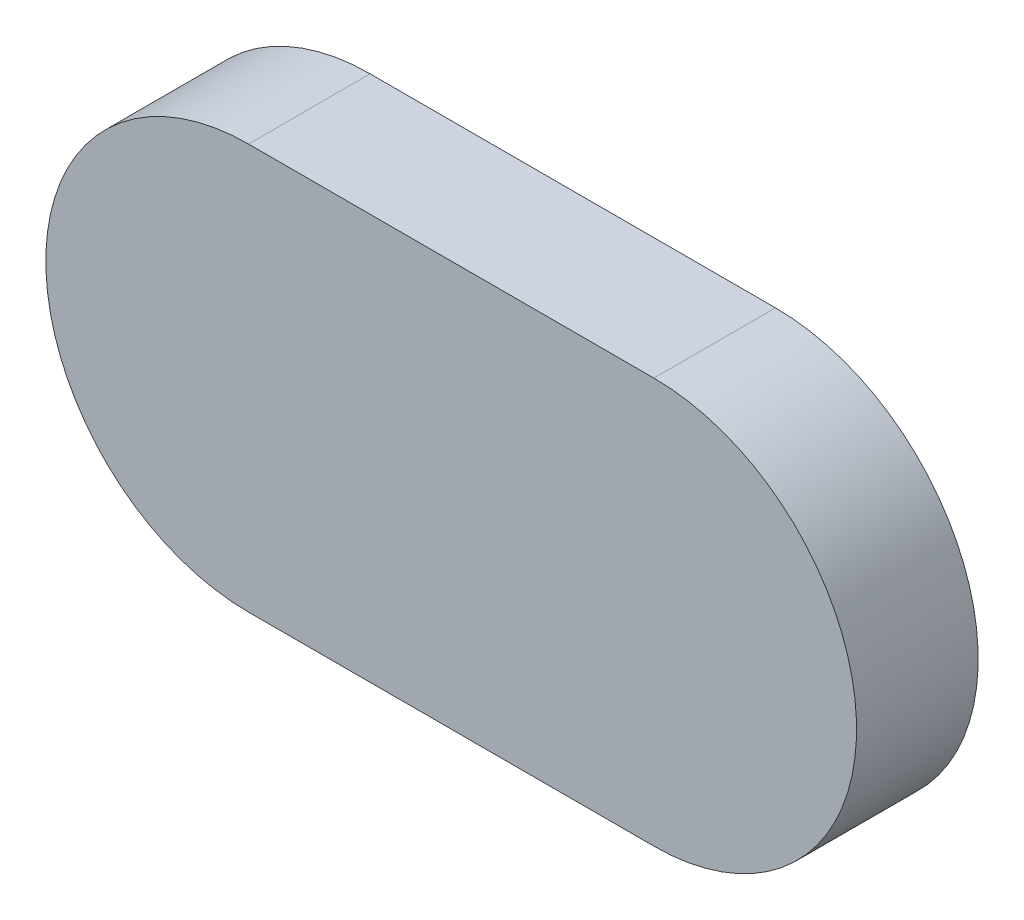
from build123d import *

# Parameters (mm, degrees)
BOSS_EXTRU_1_DEPTH = 1.5


with BuildPart() as part:
    # Esquisse1 → Boss.-Extru.1 (new body)
    with BuildSketch(Plane.XY):
        with BuildLine():
            Line((0, 2.5), (5, 2.5))
            ThreePointArc((5, 2.5), (7.5, 0), (5, -2.5))
            Line((5, -2.5), (0, -2.5))
            ThreePointArc((0, -2.5), (-2.5, 0), (0, 2.5))
        make_face()
    extrude(amount=BOSS_EXTRU_1_DEPTH)


solid = part.part
